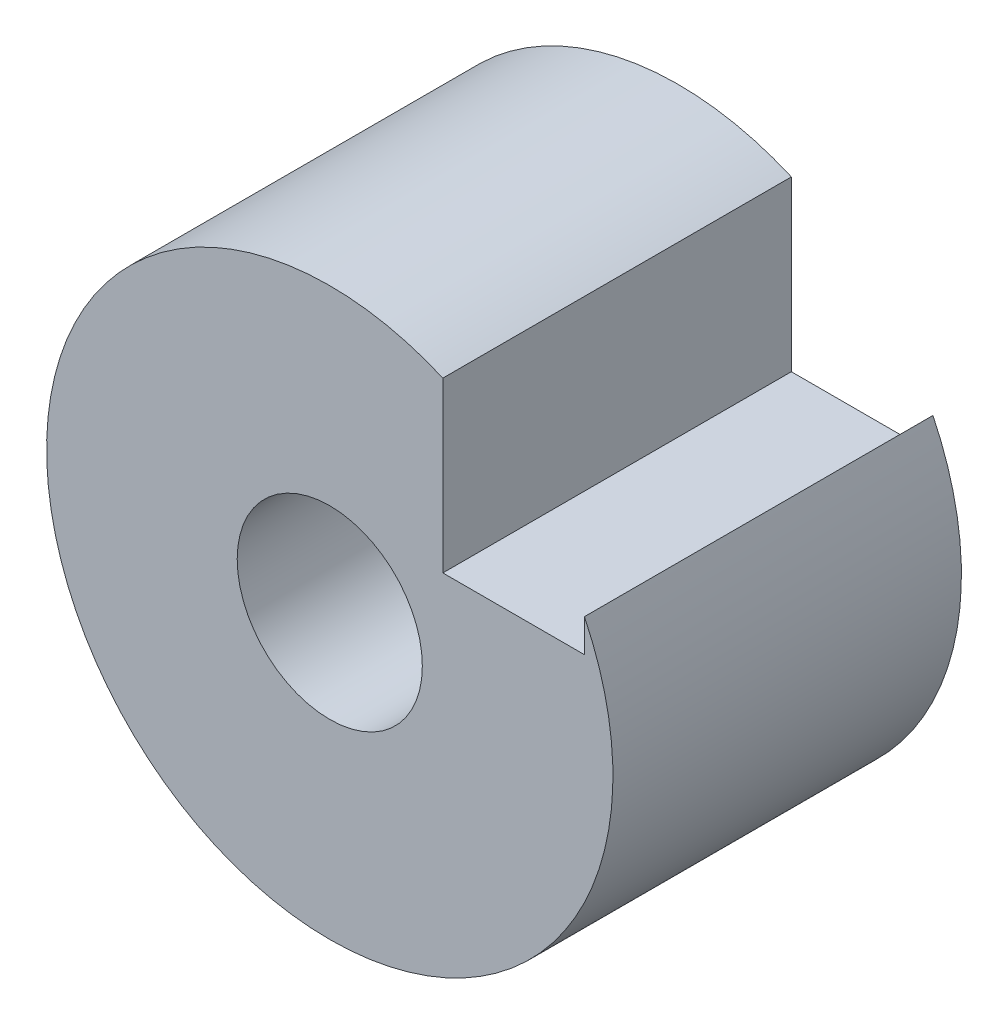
ISO-10303-21;
HEADER;
FILE_DESCRIPTION(('STEP AP214'),'2;1');
FILE_NAME('part.step','',(''),(''),'','','');
FILE_SCHEMA(('AUTOMOTIVE_DESIGN { 1 0 10303 214 1 1 1 1 }'));
ENDSEC;
DATA;
#1=APPLICATION_CONTEXT('core data for automotive mechanical design processes');
#2=APPLICATION_PROTOCOL_DEFINITION('international standard','automotive_design',2000,#1);
#3=PRODUCT_CONTEXT('',#1,'mechanical');
#4=PRODUCT('Part','Part','',(#3));
#5=PRODUCT_RELATED_PRODUCT_CATEGORY('part','',(#4));
#6=PRODUCT_DEFINITION_FORMATION('','',#4);
#7=PRODUCT_DEFINITION_CONTEXT('part definition',#1,'design');
#8=PRODUCT_DEFINITION('design','',#6,#7);
#9=PRODUCT_DEFINITION_SHAPE('','',#8);
#10=(LENGTH_UNIT() NAMED_UNIT(*) SI_UNIT(.MILLI.,.METRE.));
#11=(NAMED_UNIT(*) PLANE_ANGLE_UNIT() SI_UNIT($,.RADIAN.));
#12=(NAMED_UNIT(*) SI_UNIT($,.STERADIAN.) SOLID_ANGLE_UNIT());
#13=UNCERTAINTY_MEASURE_WITH_UNIT(LENGTH_MEASURE(1.E-05),#10,'distance_accuracy_value','');
#14=(GEOMETRIC_REPRESENTATION_CONTEXT(3) GLOBAL_UNCERTAINTY_ASSIGNED_CONTEXT((#13)) GLOBAL_UNIT_ASSIGNED_CONTEXT((#10,
#11,#12)) REPRESENTATION_CONTEXT('',''));
#15=CARTESIAN_POINT('',(0.,0.,0.));
#16=DIRECTION('',(0.,0.,1.));
#17=DIRECTION('',(1.,0.,0.));
#18=AXIS2_PLACEMENT_3D('',#15,#16,#17);
#19=CARTESIAN_POINT('',(0.,0.,16.));
#20=DIRECTION('',(0.,0.,-1.));
#21=DIRECTION('',(-1.,0.,0.));
#22=AXIS2_PLACEMENT_3D('',#19,#20,#21);
#23=CYLINDRICAL_SURFACE('',#22,13.);
#24=CARTESIAN_POINT('',(0.,0.,0.));
#25=DIRECTION('',(0.,0.,1.));
#26=DIRECTION('',(1.,0.,0.));
#27=AXIS2_PLACEMENT_3D('',#24,#25,#26);
#28=CIRCLE('',#27,13.);
#29=CARTESIAN_POINT('',(5.19149464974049,11.9184052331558,0.));
#30=VERTEX_POINT('',#29);
#31=CARTESIAN_POINT('',(11.6914946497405,5.68409648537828,0.));
#32=VERTEX_POINT('',#31);
#33=EDGE_CURVE('E120',#30,#32,#28,.T.);
#34=ORIENTED_EDGE('',*,*,#33,.T.);
#35=DIRECTION('',(0.,0.,-1.));
#36=VECTOR('',#35,1.);
#37=CARTESIAN_POINT('',(11.6914946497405,5.68409648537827,16.));
#38=LINE('',#37,#36);
#39=CARTESIAN_POINT('',(11.6914946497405,5.68409648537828,16.));
#40=VERTEX_POINT('',#39);
#41=EDGE_CURVE('E62',#32,#40,#38,.F.);
#42=ORIENTED_EDGE('',*,*,#41,.T.);
#43=CARTESIAN_POINT('',(0.,0.,16.));
#44=DIRECTION('',(0.,0.,1.));
#45=DIRECTION('',(1.,0.,0.));
#46=AXIS2_PLACEMENT_3D('',#43,#44,#45);
#47=CIRCLE('',#46,13.);
#48=CARTESIAN_POINT('',(5.19149464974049,11.9184052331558,16.));
#49=VERTEX_POINT('',#48);
#50=EDGE_CURVE('E47',#49,#40,#47,.T.);
#51=ORIENTED_EDGE('',*,*,#50,.F.);
#52=DIRECTION('',(0.,0.,-1.));
#53=VECTOR('',#52,1.);
#54=CARTESIAN_POINT('',(5.19149464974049,11.9184052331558,16.));
#55=LINE('',#54,#53);
#56=EDGE_CURVE('E86',#49,#30,#55,.T.);
#57=ORIENTED_EDGE('',*,*,#56,.T.);
#58=EDGE_LOOP('',(#34,#42,#51,#57));
#59=FACE_BOUND('',#58,.T.);
#60=ADVANCED_FACE('F39',(#59),#23,.T.);
#61=CARTESIAN_POINT('',(0.,0.,16.));
#62=DIRECTION('',(0.,0.,1.));
#63=DIRECTION('',(1.,0.,0.));
#64=AXIS2_PLACEMENT_3D('',#61,#62,#63);
#65=PLANE('',#64);
#66=DIRECTION('',(0.,1.,0.));
#67=VECTOR('',#66,1.);
#68=CARTESIAN_POINT('',(11.6914946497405,15.6004389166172,16.));
#69=LINE('',#68,#67);
#70=CARTESIAN_POINT('',(11.6914946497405,4.17238769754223,16.));
#71=VERTEX_POINT('',#70);
#72=EDGE_CURVE('E102',#71,#40,#69,.T.);
#73=ORIENTED_EDGE('',*,*,#72,.F.);
#74=DIRECTION('',(1.,0.,0.));
#75=VECTOR('',#74,1.);
#76=CARTESIAN_POINT('',(5.19149464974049,4.17238769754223,16.));
#77=LINE('',#76,#75);
#78=CARTESIAN_POINT('',(5.19149464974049,4.17238769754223,16.));
#79=VERTEX_POINT('',#78);
#80=EDGE_CURVE('E83',#79,#71,#77,.T.);
#81=ORIENTED_EDGE('',*,*,#80,.F.);
#82=DIRECTION('',(0.,-1.,0.));
#83=VECTOR('',#82,1.);
#84=CARTESIAN_POINT('',(5.19149464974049,15.6004389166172,16.));
#85=LINE('',#84,#83);
#86=EDGE_CURVE('E105',#49,#79,#85,.T.);
#87=ORIENTED_EDGE('',*,*,#86,.F.);
#88=ORIENTED_EDGE('',*,*,#50,.T.);
#89=EDGE_LOOP('',(#73,#81,#87,#88));
#90=FACE_BOUND('',#89,.T.);
#91=CARTESIAN_POINT('',(0.,0.,16.));
#92=DIRECTION('',(0.,0.,1.));
#93=DIRECTION('',(1.,0.,0.));
#94=AXIS2_PLACEMENT_3D('',#91,#92,#93);
#95=CIRCLE('',#94,4.25);
#96=CARTESIAN_POINT('',(4.25,0.,16.));
#97=VERTEX_POINT('',#96);
#98=EDGE_CURVE('E115',#97,#97,#95,.T.);
#99=ORIENTED_EDGE('',*,*,#98,.F.);
#100=EDGE_LOOP('',(#99));
#101=FACE_BOUND('',#100,.T.);
#102=ADVANCED_FACE('F133',(#90,#101),#65,.T.);
#103=CARTESIAN_POINT('',(0.,0.,0.));
#104=DIRECTION('',(0.,0.,1.));
#105=DIRECTION('',(1.,0.,0.));
#106=AXIS2_PLACEMENT_3D('',#103,#104,#105);
#107=PLANE('',#106);
#108=CARTESIAN_POINT('',(0.,0.,0.));
#109=DIRECTION('',(0.,0.,1.));
#110=DIRECTION('',(1.,0.,0.));
#111=AXIS2_PLACEMENT_3D('',#108,#109,#110);
#112=CIRCLE('',#111,4.25);
#113=CARTESIAN_POINT('',(4.25,0.,0.));
#114=VERTEX_POINT('',#113);
#115=EDGE_CURVE('E116',#114,#114,#112,.T.);
#116=ORIENTED_EDGE('',*,*,#115,.T.);
#117=EDGE_LOOP('',(#116));
#118=FACE_BOUND('',#117,.T.);
#119=DIRECTION('',(1.,0.,0.));
#120=VECTOR('',#119,1.);
#121=CARTESIAN_POINT('',(5.19149464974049,4.17238769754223,0.));
#122=LINE('',#121,#120);
#123=CARTESIAN_POINT('',(5.19149464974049,4.17238769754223,0.));
#124=VERTEX_POINT('',#123);
#125=CARTESIAN_POINT('',(11.6914946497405,4.17238769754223,0.));
#126=VERTEX_POINT('',#125);
#127=EDGE_CURVE('E54',#124,#126,#122,.T.);
#128=ORIENTED_EDGE('',*,*,#127,.T.);
#129=DIRECTION('',(0.,1.,0.));
#130=VECTOR('',#129,1.);
#131=CARTESIAN_POINT('',(11.6914946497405,15.6004389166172,0.));
#132=LINE('',#131,#130);
#133=EDGE_CURVE('E89',#126,#32,#132,.T.);
#134=ORIENTED_EDGE('',*,*,#133,.T.);
#135=ORIENTED_EDGE('',*,*,#33,.F.);
#136=DIRECTION('',(0.,-1.,0.));
#137=VECTOR('',#136,1.);
#138=CARTESIAN_POINT('',(5.19149464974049,0.,0.));
#139=LINE('',#138,#137);
#140=EDGE_CURVE('E11',#30,#124,#139,.T.);
#141=ORIENTED_EDGE('',*,*,#140,.T.);
#142=EDGE_LOOP('',(#128,#134,#135,#141));
#143=FACE_BOUND('',#142,.T.);
#144=ADVANCED_FACE('F96',(#118,#143),#107,.F.);
#145=CARTESIAN_POINT('',(0.,0.,0.));
#146=DIRECTION('',(0.,0.,1.));
#147=DIRECTION('',(1.,0.,0.));
#148=AXIS2_PLACEMENT_3D('',#145,#146,#147);
#149=CYLINDRICAL_SURFACE('',#148,4.25);
#150=ORIENTED_EDGE('',*,*,#115,.F.);
#151=EDGE_LOOP('',(#150));
#152=FACE_BOUND('',#151,.T.);
#153=ORIENTED_EDGE('',*,*,#98,.T.);
#154=EDGE_LOOP('',(#153));
#155=FACE_BOUND('',#154,.T.);
#156=ADVANCED_FACE('F139',(#152,#155),#149,.F.);
#157=CARTESIAN_POINT('',(11.6914946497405,15.6004389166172,0.));
#158=DIRECTION('',(1.,0.,0.));
#159=DIRECTION('',(0.,1.,0.));
#160=AXIS2_PLACEMENT_3D('',#157,#158,#159);
#161=PLANE('',#160);
#162=ORIENTED_EDGE('',*,*,#133,.F.);
#163=DIRECTION('',(0.,0.,1.));
#164=VECTOR('',#163,1.);
#165=CARTESIAN_POINT('',(11.6914946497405,4.17238769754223,0.));
#166=LINE('',#165,#164);
#167=EDGE_CURVE('E80',#126,#71,#166,.T.);
#168=ORIENTED_EDGE('',*,*,#167,.T.);
#169=ORIENTED_EDGE('',*,*,#72,.T.);
#170=ORIENTED_EDGE('',*,*,#41,.F.);
#171=EDGE_LOOP('',(#162,#168,#169,#170));
#172=FACE_BOUND('',#171,.T.);
#173=ADVANCED_FACE('F90',(#172),#161,.F.);
#174=CARTESIAN_POINT('',(5.19149464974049,15.6004389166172,0.));
#175=DIRECTION('',(-1.,0.,0.));
#176=DIRECTION('',(0.,-1.,0.));
#177=AXIS2_PLACEMENT_3D('',#174,#175,#176);
#178=PLANE('',#177);
#179=ORIENTED_EDGE('',*,*,#86,.T.);
#180=DIRECTION('',(0.,0.,1.));
#181=VECTOR('',#180,1.);
#182=CARTESIAN_POINT('',(5.19149464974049,4.17238769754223,0.));
#183=LINE('',#182,#181);
#184=EDGE_CURVE('E87',#124,#79,#183,.T.);
#185=ORIENTED_EDGE('',*,*,#184,.F.);
#186=ORIENTED_EDGE('',*,*,#140,.F.);
#187=ORIENTED_EDGE('',*,*,#56,.F.);
#188=EDGE_LOOP('',(#179,#185,#186,#187));
#189=FACE_BOUND('',#188,.T.);
#190=ADVANCED_FACE('F131',(#189),#178,.F.);
#191=CARTESIAN_POINT('',(5.19149464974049,4.17238769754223,0.));
#192=DIRECTION('',(0.,-1.,0.));
#193=DIRECTION('',(0.,0.,-1.));
#194=AXIS2_PLACEMENT_3D('',#191,#192,#193);
#195=PLANE('',#194);
#196=ORIENTED_EDGE('',*,*,#80,.T.);
#197=ORIENTED_EDGE('',*,*,#167,.F.);
#198=ORIENTED_EDGE('',*,*,#127,.F.);
#199=ORIENTED_EDGE('',*,*,#184,.T.);
#200=EDGE_LOOP('',(#196,#197,#198,#199));
#201=FACE_BOUND('',#200,.T.);
#202=ADVANCED_FACE('F81',(#201),#195,.F.);
#203=CLOSED_SHELL('',(#60,#102,#144,#156,#173,#190,#202));
#204=MANIFOLD_SOLID_BREP('B2',#203);
#205=ADVANCED_BREP_SHAPE_REPRESENTATION('',(#18,#204),#14);
#206=SHAPE_DEFINITION_REPRESENTATION(#9,#205);
ENDSEC;
END-ISO-10303-21;
